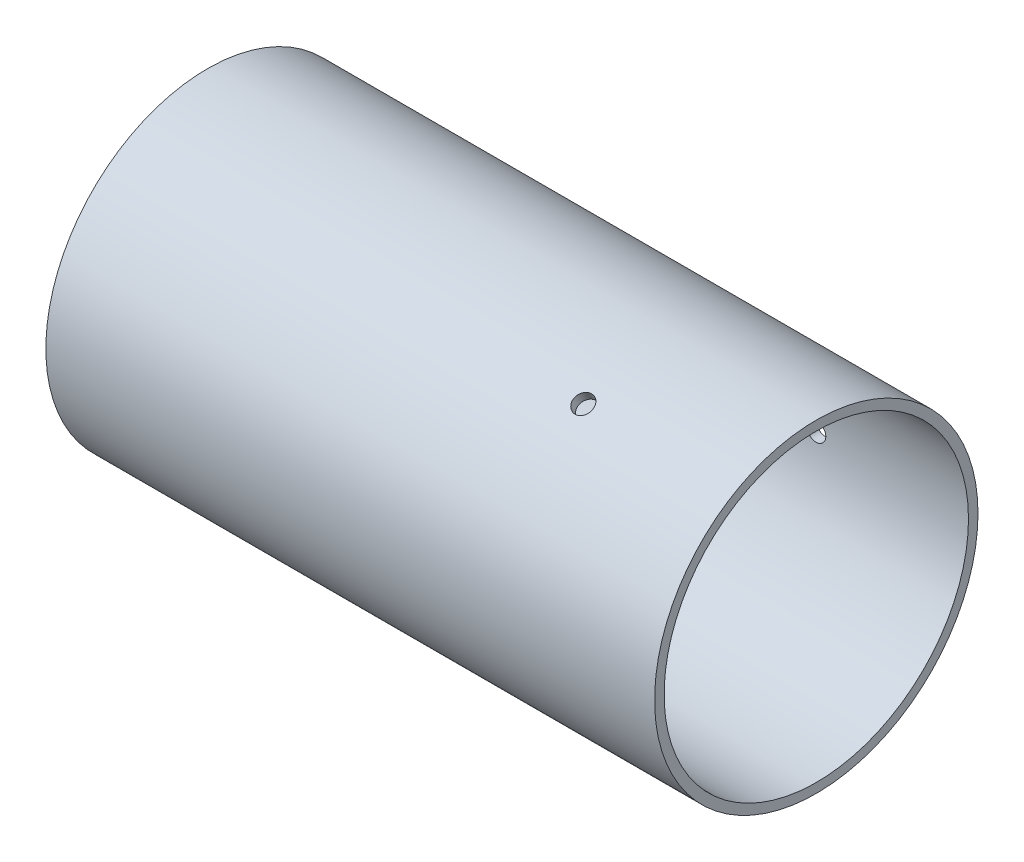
ISO-10303-21;
HEADER;
FILE_DESCRIPTION(('STEP AP214'),'2;1');
FILE_NAME('part.step','',(''),(''),'','','');
FILE_SCHEMA(('AUTOMOTIVE_DESIGN { 1 0 10303 214 1 1 1 1 }'));
ENDSEC;
DATA;
#1=APPLICATION_CONTEXT('core data for automotive mechanical design processes');
#2=APPLICATION_PROTOCOL_DEFINITION('international standard','automotive_design',2000,#1);
#3=PRODUCT_CONTEXT('',#1,'mechanical');
#4=PRODUCT('Part','Part','',(#3));
#5=PRODUCT_RELATED_PRODUCT_CATEGORY('part','',(#4));
#6=PRODUCT_DEFINITION_FORMATION('','',#4);
#7=PRODUCT_DEFINITION_CONTEXT('part definition',#1,'design');
#8=PRODUCT_DEFINITION('design','',#6,#7);
#9=PRODUCT_DEFINITION_SHAPE('','',#8);
#10=(LENGTH_UNIT() NAMED_UNIT(*) SI_UNIT(.MILLI.,.METRE.));
#11=(NAMED_UNIT(*) PLANE_ANGLE_UNIT() SI_UNIT($,.RADIAN.));
#12=(NAMED_UNIT(*) SI_UNIT($,.STERADIAN.) SOLID_ANGLE_UNIT());
#13=UNCERTAINTY_MEASURE_WITH_UNIT(LENGTH_MEASURE(1.E-05),#10,'distance_accuracy_value','');
#14=(GEOMETRIC_REPRESENTATION_CONTEXT(3) GLOBAL_UNCERTAINTY_ASSIGNED_CONTEXT((#13)) GLOBAL_UNIT_ASSIGNED_CONTEXT((#10,
#11,#12)) REPRESENTATION_CONTEXT('',''));
#15=CARTESIAN_POINT('',(0.,0.,0.));
#16=DIRECTION('',(0.,0.,1.));
#17=DIRECTION('',(1.,0.,0.));
#18=AXIS2_PLACEMENT_3D('',#15,#16,#17);
#19=CARTESIAN_POINT('',(101.6,0.,0.));
#20=DIRECTION('',(1.,0.,0.));
#21=DIRECTION('',(0.,0.,-1.));
#22=AXIS2_PLACEMENT_3D('',#19,#20,#21);
#23=PLANE('',#22);
#24=CARTESIAN_POINT('',(101.6,0.,0.));
#25=DIRECTION('',(1.,0.,0.));
#26=DIRECTION('',(0.,0.,-1.));
#27=AXIS2_PLACEMENT_3D('',#24,#25,#26);
#28=CIRCLE('',#27,26.9875);
#29=CARTESIAN_POINT('',(101.6,0.,-26.9875));
#30=VERTEX_POINT('',#29);
#31=EDGE_CURVE('E10',#30,#30,#28,.T.);
#32=ORIENTED_EDGE('',*,*,#31,.T.);
#33=EDGE_LOOP('',(#32));
#34=FACE_BOUND('',#33,.T.);
#35=CARTESIAN_POINT('',(101.6,0.,0.));
#36=DIRECTION('',(1.,0.,0.));
#37=DIRECTION('',(0.,0.,-1.));
#38=AXIS2_PLACEMENT_3D('',#35,#36,#37);
#39=CIRCLE('',#38,25.4);
#40=CARTESIAN_POINT('',(101.6,0.,-25.4));
#41=VERTEX_POINT('',#40);
#42=EDGE_CURVE('E47',#41,#41,#39,.T.);
#43=ORIENTED_EDGE('',*,*,#42,.F.);
#44=EDGE_LOOP('',(#43));
#45=FACE_BOUND('',#44,.T.);
#46=ADVANCED_FACE('F29',(#34,#45),#23,.T.);
#47=CARTESIAN_POINT('',(0.,0.,0.));
#48=DIRECTION('',(1.,0.,0.));
#49=DIRECTION('',(0.,0.,-1.));
#50=AXIS2_PLACEMENT_3D('',#47,#48,#49);
#51=PLANE('',#50);
#52=CARTESIAN_POINT('',(0.,0.,0.));
#53=DIRECTION('',(1.,0.,0.));
#54=DIRECTION('',(0.,0.,-1.));
#55=AXIS2_PLACEMENT_3D('',#52,#53,#54);
#56=CIRCLE('',#55,26.9875);
#57=CARTESIAN_POINT('',(0.,0.,-26.9875));
#58=VERTEX_POINT('',#57);
#59=EDGE_CURVE('E42',#58,#58,#56,.T.);
#60=ORIENTED_EDGE('',*,*,#59,.F.);
#61=EDGE_LOOP('',(#60));
#62=FACE_BOUND('',#61,.T.);
#63=CARTESIAN_POINT('',(0.,0.,0.));
#64=DIRECTION('',(1.,0.,0.));
#65=DIRECTION('',(0.,0.,-1.));
#66=AXIS2_PLACEMENT_3D('',#63,#64,#65);
#67=CIRCLE('',#66,25.4);
#68=CARTESIAN_POINT('',(0.,0.,-25.4));
#69=VERTEX_POINT('',#68);
#70=EDGE_CURVE('E78',#69,#69,#67,.T.);
#71=ORIENTED_EDGE('',*,*,#70,.T.);
#72=EDGE_LOOP('',(#71));
#73=FACE_BOUND('',#72,.T.);
#74=ADVANCED_FACE('F89',(#62,#73),#51,.F.);
#75=CARTESIAN_POINT('',(101.6,0.,0.));
#76=DIRECTION('',(-1.,0.,0.));
#77=DIRECTION('',(0.,0.,1.));
#78=AXIS2_PLACEMENT_3D('',#75,#76,#77);
#79=CYLINDRICAL_SURFACE('',#78,26.9875);
#80=CARTESIAN_POINT('',(76.2,-22.5376398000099,14.8451995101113));
#81=CARTESIAN_POINT('',(76.289087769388,-22.5376423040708,14.8451964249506));
#82=CARTESIAN_POINT('',(76.3782381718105,-22.5417887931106,14.8389065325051));
#83=CARTESIAN_POINT('',(76.5540780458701,-22.5582388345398,14.8138864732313));
#84=CARTESIAN_POINT('',(76.6407645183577,-22.5705519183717,14.7951417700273));
#85=CARTESIAN_POINT('',(76.8091039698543,-22.6028857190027,14.7456970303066));
#86=CARTESIAN_POINT('',(76.8907595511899,-22.6229024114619,14.7150032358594));
#87=CARTESIAN_POINT('',(77.0467482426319,-22.6699237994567,14.6424578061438));
#88=CARTESIAN_POINT('',(77.1210830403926,-22.6969268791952,14.600608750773));
#89=CARTESIAN_POINT('',(77.2604418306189,-22.7570150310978,14.5067750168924));
#90=CARTESIAN_POINT('',(77.3254546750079,-22.7901072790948,14.4547783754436));
#91=CARTESIAN_POINT('',(77.4442287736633,-22.8612240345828,14.3420369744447));
#92=CARTESIAN_POINT('',(77.4979895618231,-22.8992487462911,14.2812918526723));
#93=CARTESIAN_POINT('',(77.5927666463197,-22.9789967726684,14.1526177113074));
#94=CARTESIAN_POINT('',(77.6337738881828,-23.0207226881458,14.0846836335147));
#95=CARTESIAN_POINT('',(77.7018218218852,-23.1065083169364,13.9435019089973));
#96=CARTESIAN_POINT('',(77.7288626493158,-23.1505680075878,13.8702543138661));
#97=CARTESIAN_POINT('',(77.7681796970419,-23.2396042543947,13.7205510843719));
#98=CARTESIAN_POINT('',(77.7804731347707,-23.2845796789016,13.6440992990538));
#99=CARTESIAN_POINT('',(77.7899995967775,-23.3741648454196,13.4900523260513));
#100=CARTESIAN_POINT('',(77.7872327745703,-23.4187745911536,13.41245715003));
#101=CARTESIAN_POINT('',(77.7667314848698,-23.5063164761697,13.2584343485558));
#102=CARTESIAN_POINT('',(77.7490155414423,-23.5492506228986,13.1820053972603));
#103=CARTESIAN_POINT('',(77.6991476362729,-23.6323579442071,13.0324264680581));
#104=CARTESIAN_POINT('',(77.6669955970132,-23.6725311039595,12.959276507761));
#105=CARTESIAN_POINT('',(77.5891471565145,-23.7491343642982,12.8183546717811));
#106=CARTESIAN_POINT('',(77.5434423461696,-23.7855621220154,12.7505861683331));
#107=CARTESIAN_POINT('',(77.4397918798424,-23.8537885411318,12.6224880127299));
#108=CARTESIAN_POINT('',(77.3818461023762,-23.8855871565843,12.562158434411));
#109=CARTESIAN_POINT('',(77.255253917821,-23.9438940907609,12.450665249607));
#110=CARTESIAN_POINT('',(77.1865914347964,-23.9703943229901,12.3995156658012));
#111=CARTESIAN_POINT('',(77.0405712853,-24.0174850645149,12.3080551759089));
#112=CARTESIAN_POINT('',(76.9632136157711,-24.0380755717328,12.2677442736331));
#113=CARTESIAN_POINT('',(76.801988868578,-24.0729318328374,12.1992046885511));
#114=CARTESIAN_POINT('',(76.7181214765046,-24.0871972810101,12.1709765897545));
#115=CARTESIAN_POINT('',(76.546262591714,-24.1091224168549,12.1274882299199));
#116=CARTESIAN_POINT('',(76.4582711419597,-24.1167821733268,12.1122278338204));
#117=CARTESIAN_POINT('',(76.2808030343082,-24.1253425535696,12.0951682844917));
#118=CARTESIAN_POINT('',(76.1913287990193,-24.1262532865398,12.0933489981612));
#119=CARTESIAN_POINT('',(76.0133108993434,-24.1213250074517,12.103175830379));
#120=CARTESIAN_POINT('',(75.9247672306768,-24.1154860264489,12.114821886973));
#121=CARTESIAN_POINT('',(75.7511873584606,-24.0971764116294,12.1511997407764));
#122=CARTESIAN_POINT('',(75.6661487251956,-24.0847104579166,12.1759223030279));
#123=CARTESIAN_POINT('',(75.5019179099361,-24.0533912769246,12.2376760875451));
#124=CARTESIAN_POINT('',(75.4227257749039,-24.0345379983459,12.2747074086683));
#125=CARTESIAN_POINT('',(75.2723325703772,-23.9907935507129,12.3599867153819));
#126=CARTESIAN_POINT('',(75.2011411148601,-23.9658952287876,12.4082479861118));
#127=CARTESIAN_POINT('',(75.068866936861,-23.9105895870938,12.5144891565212));
#128=CARTESIAN_POINT('',(75.0077843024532,-23.880182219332,12.572469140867));
#129=CARTESIAN_POINT('',(74.8973858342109,-23.8144826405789,12.696475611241));
#130=CARTESIAN_POINT('',(74.8480845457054,-23.7791844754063,12.762511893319));
#131=CARTESIAN_POINT('',(74.76274775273,-23.7045521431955,12.9006013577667));
#132=CARTESIAN_POINT('',(74.7267121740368,-23.6652179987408,12.9726545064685));
#133=CARTESIAN_POINT('',(74.668955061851,-23.5835127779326,13.120602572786));
#134=CARTESIAN_POINT('',(74.6472242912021,-23.5411436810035,13.1964949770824));
#135=CARTESIAN_POINT('',(74.6186634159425,-23.4544592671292,13.3499535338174));
#136=CARTESIAN_POINT('',(74.6118331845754,-23.4101439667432,13.4275196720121));
#137=CARTESIAN_POINT('',(74.6132684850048,-23.3208676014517,13.5819820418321));
#138=CARTESIAN_POINT('',(74.6215112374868,-23.2759076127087,13.6588791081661));
#139=CARTESIAN_POINT('',(74.6528113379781,-23.1865885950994,13.8099590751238));
#140=CARTESIAN_POINT('',(74.6758687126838,-23.1422295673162,13.8841419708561));
#141=CARTESIAN_POINT('',(74.7361385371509,-23.055466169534,14.0277467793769));
#142=CARTESIAN_POINT('',(74.773350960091,-23.0130617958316,14.0971687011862));
#143=CARTESIAN_POINT('',(74.8608711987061,-22.9315529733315,14.2293735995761));
#144=CARTESIAN_POINT('',(74.9111786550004,-22.8924484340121,14.2921567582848));
#145=CARTESIAN_POINT('',(75.0235444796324,-22.8187681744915,14.4095034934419));
#146=CARTESIAN_POINT('',(75.0856191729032,-22.7841988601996,14.4640554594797));
#147=CARTESIAN_POINT('',(75.2197381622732,-22.7208166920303,14.5634174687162));
#148=CARTESIAN_POINT('',(75.2917848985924,-22.69200525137,14.6082251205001));
#149=CARTESIAN_POINT('',(75.4438769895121,-22.6411235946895,14.6869631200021));
#150=CARTESIAN_POINT('',(75.52393145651,-22.6190611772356,14.72088088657));
#151=CARTESIAN_POINT('',(75.6896418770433,-22.5825298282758,14.7768613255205));
#152=CARTESIAN_POINT('',(75.7752911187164,-22.5680519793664,14.7989379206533));
#153=CARTESIAN_POINT('',(75.9178891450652,-22.5509876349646,14.8249198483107));
#154=CARTESIAN_POINT('',(75.9739155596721,-22.5459901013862,14.8325157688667));
#155=CARTESIAN_POINT('',(76.0866195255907,-22.5393153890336,14.8426565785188));
#156=CARTESIAN_POINT('',(76.1432970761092,-22.5376382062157,14.8452014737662));
#157=CARTESIAN_POINT('',(76.2,-22.5376398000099,14.8451995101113));
#158=B_SPLINE_CURVE_WITH_KNOTS('',3,(#80,#81,#82,#83,#84,#85,#86,#87,#88,#89,#90,#91,#92,#93,
#94,#95,#96,#97,#98,#99,#100,#101,#102,#103,#104,#105,#106,#107,#108,#109,#110,#111,#112,#113,
#114,#115,#116,#117,#118,#119,#120,#121,#122,#123,#124,#125,#126,#127,#128,#129,#130,#131,#132,
#133,#134,#135,#136,#137,#138,#139,#140,#141,#142,#143,#144,#145,#146,#147,#148,#149,#150,#151,
#152,#153,#154,#155,#156,#157),.UNSPECIFIED.,.T.,.F.,(4,2,2,2,2,2,2,2,2,2,2,2,2,2,2,2,2,2,2,2,2,
2,2,2,2,2,2,2,2,2,2,2,2,2,2,2,2,2,4),(0.,0.26705631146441,0.534424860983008,0.80165392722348,
1.068821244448,1.33630544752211,1.60380072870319,1.87148548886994,2.13916765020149,
2.40653699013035,2.67390360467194,2.94093940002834,3.20797662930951,3.47517989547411,
3.74238581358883,4.00999648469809,4.27760724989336,4.54523094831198,4.81285185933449,
5.08007182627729,5.34729056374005,5.61432083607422,5.88135325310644,6.14870319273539,
6.41605546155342,6.68373611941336,6.95141527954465,7.218921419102,7.48642528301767,
7.75352521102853,8.02062562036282,8.28772552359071,8.55481809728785,8.82228396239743,
9.08981539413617,9.35765480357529,9.62517859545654,9.79515582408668,9.96513284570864),.UNSPECIFIED.);
#159=CARTESIAN_POINT('',(76.2,-22.5376398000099,14.8451995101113));
#160=VERTEX_POINT('',#159);
#161=EDGE_CURVE('E118',#160,#160,#158,.T.);
#162=ORIENTED_EDGE('',*,*,#161,.T.);
#163=EDGE_LOOP('',(#162));
#164=FACE_BOUND('',#163,.T.);
#165=CARTESIAN_POINT('',(76.2,24.1251398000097,12.095568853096));
#166=CARTESIAN_POINT('',(76.289087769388,24.1251383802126,12.0955725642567));
#167=CARTESIAN_POINT('',(76.3782381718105,24.1217644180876,12.1023084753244));
#168=CARTESIAN_POINT('',(76.5540780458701,24.1083214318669,12.1290646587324));
#169=CARTESIAN_POINT('',(76.6407645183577,24.0982445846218,12.1491004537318));
#170=CARTESIAN_POINT('',(76.8091039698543,24.0715910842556,12.2018247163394));
#171=CARTESIAN_POINT('',(76.8907595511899,24.0550178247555,12.2345065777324));
#172=CARTESIAN_POINT('',(77.0467482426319,24.0157023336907,12.3115010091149));
#173=CARTESIAN_POINT('',(77.1210830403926,23.9929615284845,12.3558108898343));
#174=CARTESIAN_POINT('',(77.2604418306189,23.9417432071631,12.4547656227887));
#175=CARTESIAN_POINT('',(77.3254546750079,23.9132589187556,12.5094226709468));
#176=CARTESIAN_POINT('',(77.4442287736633,23.8511803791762,12.6273822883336));
#177=CARTESIAN_POINT('',(77.4979895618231,23.8175859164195,12.6906852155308));
#178=CARTESIAN_POINT('',(77.5927666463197,23.746024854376,12.8240861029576));
#179=CARTESIAN_POINT('',(77.6337738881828,23.7080551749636,12.8941888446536));
#180=CARTESIAN_POINT('',(77.7018218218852,23.6286810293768,13.0390722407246));
#181=CARTESIAN_POINT('',(77.7288626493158,23.5872765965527,13.1138528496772));
#182=CARTESIAN_POINT('',(77.7681796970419,23.5021479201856,13.2658121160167));
#183=CARTESIAN_POINT('',(77.7804731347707,23.4584264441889,13.3429878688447));
#184=CARTESIAN_POINT('',(77.7899995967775,23.3698104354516,13.4975943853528));
#185=CARTESIAN_POINT('',(77.7872327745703,23.3249159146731,13.5750251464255));
#186=CARTESIAN_POINT('',(77.7667314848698,23.2352991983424,13.7278500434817));
#187=CARTESIAN_POINT('',(77.7490155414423,23.1905768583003,13.8032465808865));
#188=CARTESIAN_POINT('',(77.6991476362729,23.1025913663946,13.9500090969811));
#189=CARTESIAN_POINT('',(77.6669955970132,23.0593282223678,14.0213750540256));
#190=CARTESIAN_POINT('',(77.5891471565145,22.9755879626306,14.1581763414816));
#191=CARTESIAN_POINT('',(77.5434423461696,22.9351125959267,14.2236079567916));
#192=CARTESIAN_POINT('',(77.4397918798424,22.8582895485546,14.3467428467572));
#193=CARTESIAN_POINT('',(77.3818461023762,22.8219419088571,14.4044460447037));
#194=CARTESIAN_POINT('',(77.255253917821,22.7545394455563,14.5106879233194));
#195=CARTESIAN_POINT('',(77.1865914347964,22.723492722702,14.559212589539));
#196=CARTESIAN_POINT('',(77.0405712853,22.6678309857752,14.6457246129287));
#197=CARTESIAN_POINT('',(76.9632136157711,22.6432159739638,14.6837119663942));
#198=CARTESIAN_POINT('',(76.801988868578,22.6012870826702,14.7481681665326));
#199=CARTESIAN_POINT('',(76.7181214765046,22.5839735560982,14.7746364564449));
#200=CARTESIAN_POINT('',(76.546262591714,22.557274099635,14.8153683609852));
#201=CARTESIAN_POINT('',(76.4582711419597,22.5478880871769,14.8296321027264));
#202=CARTESIAN_POINT('',(76.2808030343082,22.5373942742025,14.845575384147));
#203=CARTESIAN_POINT('',(76.1913287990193,22.5362740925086,14.8472737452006));
#204=CARTESIAN_POINT('',(76.0133108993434,22.5423202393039,14.8380923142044));
#205=CARTESIAN_POINT('',(75.9247672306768,22.5494865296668,14.8272125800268));
#206=CARTESIAN_POINT('',(75.7511873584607,22.5718358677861,14.7931670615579));
#207=CARTESIAN_POINT('',(75.6661487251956,22.5870132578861,14.7700099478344));
#208=CARTESIAN_POINT('',(75.5019179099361,22.6248340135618,14.7120098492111));
#209=CARTESIAN_POINT('',(75.4227257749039,22.6474774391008,14.6771667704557));
#210=CARTESIAN_POINT('',(75.2723325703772,22.6994592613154,14.5966433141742));
#211=CARTESIAN_POINT('',(75.2011411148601,22.7288055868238,14.5509500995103));
#212=CARTESIAN_POINT('',(75.068866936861,22.7931603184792,14.4499334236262));
#213=CARTESIAN_POINT('',(75.0077843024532,22.8281687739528,14.3946098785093));
#214=CARTESIAN_POINT('',(74.8973858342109,22.9027117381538,14.2757091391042));
#215=CARTESIAN_POINT('',(74.8480845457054,22.9422517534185,14.2121218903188));
#216=CARTESIAN_POINT('',(74.76274775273,23.0245245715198,14.0784436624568));
#217=CARTESIAN_POINT('',(74.7267121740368,23.0672573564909,14.0083527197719));
#218=CARTESIAN_POINT('',(74.668955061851,23.1545315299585,13.8636198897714));
#219=CARTESIAN_POINT('',(74.6472242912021,23.1990717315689,13.7889809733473));
#220=CARTESIAN_POINT('',(74.6186634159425,23.2886285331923,13.6371807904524));
#221=CARTESIAN_POINT('',(74.6118331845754,23.3336451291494,13.5600195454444));
#222=CARTESIAN_POINT('',(74.6132684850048,23.4227752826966,13.4054727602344));
#223=CARTESIAN_POINT('',(74.6215112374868,23.4668901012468,13.3280877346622));
#224=CARTESIAN_POINT('',(74.6528113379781,23.5530696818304,13.1751952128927));
#225=CARTESIAN_POINT('',(74.6758687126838,23.5951344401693,13.099687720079));
#226=CARTESIAN_POINT('',(74.7361385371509,23.6761181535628,12.9527460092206));
#227=CARTESIAN_POINT('',(74.773350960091,23.715037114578,12.8813117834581));
#228=CARTESIAN_POINT('',(74.8608711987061,23.7887755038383,12.7446206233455));
#229=CARTESIAN_POINT('',(74.9111786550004,23.8235950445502,12.6793635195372));
#230=CARTESIAN_POINT('',(75.0235444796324,23.8883801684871,12.5568811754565));
#231=CARTESIAN_POINT('',(75.0856191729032,23.9183388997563,12.4996672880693));
#232=CARTESIAN_POINT('',(75.2197381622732,23.9726978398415,12.3950957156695));
#233=CARTESIAN_POINT('',(75.2917848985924,23.9970966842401,12.3477404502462));
#234=CARTESIAN_POINT('',(75.4438769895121,24.0398449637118,12.2643066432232));
#235=CARTESIAN_POINT('',(75.52393145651,24.0581874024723,12.2282411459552));
#236=CARTESIAN_POINT('',(75.6896418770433,24.0884022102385,12.1686138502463));
#237=CARTESIAN_POINT('',(75.7752911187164,24.1002821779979,12.1450373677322));
#238=CARTESIAN_POINT('',(75.9178891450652,24.1142510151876,12.1172682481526));
#239=CARTESIAN_POINT('',(75.9739155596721,24.118330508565,12.1091422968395));
#240=CARTESIAN_POINT('',(76.0866195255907,24.1237753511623,12.0982914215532));
#241=CARTESIAN_POINT('',(76.1432970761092,24.1251407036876,12.0955664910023));
#242=CARTESIAN_POINT('',(76.2,24.1251398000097,12.095568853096));
#243=B_SPLINE_CURVE_WITH_KNOTS('',3,(#165,#166,#167,#168,#169,#170,#171,#172,#173,#174,#175,
#176,#177,#178,#179,#180,#181,#182,#183,#184,#185,#186,#187,#188,#189,#190,#191,#192,#193,#194,
#195,#196,#197,#198,#199,#200,#201,#202,#203,#204,#205,#206,#207,#208,#209,#210,#211,#212,#213,
#214,#215,#216,#217,#218,#219,#220,#221,#222,#223,#224,#225,#226,#227,#228,#229,#230,#231,#232,
#233,#234,#235,#236,#237,#238,#239,#240,#241,#242),.UNSPECIFIED.,.T.,.F.,(4,2,2,2,2,2,2,2,2,2,2,
2,2,2,2,2,2,2,2,2,2,2,2,2,2,2,2,2,2,2,2,2,2,2,2,2,2,2,4),(0.,0.26705631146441,0.534424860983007,
0.801653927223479,1.068821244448,1.33630544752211,1.60380072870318,1.87148548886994,
2.13916765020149,2.40653699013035,2.67390360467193,2.94093940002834,3.20797662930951,
3.47517989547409,3.74238581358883,4.00999648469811,4.27760724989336,4.54523094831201,
4.81285185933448,5.08007182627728,5.34729056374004,5.61432083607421,5.88135325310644,
6.1487031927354,6.41605546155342,6.68373611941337,6.95141527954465,7.218921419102,
7.48642528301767,7.75352521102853,8.02062562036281,8.28772552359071,8.55481809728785,
8.82228396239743,9.08981539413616,9.35765480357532,9.62517859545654,9.79515582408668,
9.96513284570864),.UNSPECIFIED.);
#244=CARTESIAN_POINT('',(76.2,24.1251398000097,12.095568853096));
#245=VERTEX_POINT('',#244);
#246=EDGE_CURVE('E57',#245,#245,#243,.T.);
#247=ORIENTED_EDGE('',*,*,#246,.T.);
#248=EDGE_LOOP('',(#247));
#249=FACE_BOUND('',#248,.T.);
#250=CARTESIAN_POINT('',(77.7875,0.,-26.9875));
#251=CARTESIAN_POINT('',(77.7874960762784,0.0890879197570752,-26.9874993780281));
#252=CARTESIAN_POINT('',(77.7799756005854,0.178238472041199,-26.9870541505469));
#253=CARTESIAN_POINT('',(77.7500824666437,0.354078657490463,-26.9853208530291));
#254=CARTESIAN_POINT('',(77.7276924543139,0.440765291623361,-26.9840317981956));
#255=CARTESIAN_POINT('',(77.6687049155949,0.609105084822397,-26.980756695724));
#256=CARTESIAN_POINT('',(77.6321148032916,0.690760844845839,-26.9787710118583));
#257=CARTESIAN_POINT('',(77.5457775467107,0.84674983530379,-26.9743260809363));
#258=CARTESIAN_POINT('',(77.4960334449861,0.921084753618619,-26.9718669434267));
#259=CARTESIAN_POINT('',(77.3847267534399,1.06044340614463,-26.9667478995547));
#260=CARTESIAN_POINT('',(77.3231502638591,1.12545603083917,-26.9640877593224));
#261=CARTESIAN_POINT('',(77.1899551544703,1.24422970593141,-26.9588685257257));
#262=CARTESIAN_POINT('',(77.1183361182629,1.29799028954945,-26.9563094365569));
#263=CARTESIAN_POINT('',(76.9670271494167,1.39276716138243,-26.9515791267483));
#264=CARTESIAN_POINT('',(76.8873315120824,1.43377435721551,-26.9494081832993));
#265=CARTESIAN_POINT('',(76.7221716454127,1.50182219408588,-26.9457019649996));
#266=CARTESIAN_POINT('',(76.6367074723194,1.52886297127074,-26.9441666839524));
#267=CARTESIAN_POINT('',(76.462542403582,1.5681799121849,-26.941907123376));
#268=CARTESIAN_POINT('',(76.3738454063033,1.58047328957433,-26.9411818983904));
#269=CARTESIAN_POINT('',(76.1956440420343,1.5899995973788,-26.9406214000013));
#270=CARTESIAN_POINT('',(76.1061396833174,1.58723268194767,-26.9407861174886));
#271=CARTESIAN_POINT('',(75.9289814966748,1.56673124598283,-26.9419860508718));
#272=CARTESIAN_POINT('',(75.8413255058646,1.54901534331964,-26.9430201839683));
#273=CARTESIAN_POINT('',(75.6702336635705,1.49914769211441,-26.9458406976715));
#274=CARTESIAN_POINT('',(75.5867978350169,1.46699586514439,-26.9476270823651));
#275=CARTESIAN_POINT('',(75.4264548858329,1.38914786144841,-26.9517520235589));
#276=CARTESIAN_POINT('',(75.3495518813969,1.34344322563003,-26.9540909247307));
#277=CARTESIAN_POINT('',(75.2045025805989,1.23979313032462,-26.959056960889));
#278=CARTESIAN_POINT('',(75.1363563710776,1.18184754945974,-26.9616840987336));
#279=CARTESIAN_POINT('',(75.0106467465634,1.05525550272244,-26.9669353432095));
#280=CARTESIAN_POINT('',(74.9530995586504,0.986592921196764,-26.9695594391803));
#281=CARTESIAN_POINT('',(74.8503466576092,0.840572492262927,-26.9745050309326));
#282=CARTESIAN_POINT('',(74.8051409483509,0.76321464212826,-26.9768265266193));
#283=CARTESIAN_POINT('',(74.7283556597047,0.601989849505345,-26.9809054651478));
#284=CARTESIAN_POINT('',(74.6967766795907,0.518122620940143,-26.9826628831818));
#285=CARTESIAN_POINT('',(74.6481520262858,0.346264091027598,-26.9854152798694));
#286=CARTESIAN_POINT('',(74.6311062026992,0.258272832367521,-26.986410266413));
#287=CARTESIAN_POINT('',(74.6120518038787,0.0808048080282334,-26.9875246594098));
#288=CARTESIAN_POINT('',(74.6100207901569,-0.00866954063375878,-26.9876453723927));
#289=CARTESIAN_POINT('',(74.6209950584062,-0.18668769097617,-26.9870010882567));
#290=CARTESIAN_POINT('',(74.6340002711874,-0.275231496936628,-26.9862360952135));
#291=CARTESIAN_POINT('',(74.6746592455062,-0.448812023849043,-26.9839073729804));
#292=CARTESIAN_POINT('',(74.70230272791,-0.533851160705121,-26.9823442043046));
#293=CARTESIAN_POINT('',(74.7714431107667,-0.698082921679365,-26.9785950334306));
#294=CARTESIAN_POINT('',(74.8129401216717,-0.777275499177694,-26.9764090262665));
#295=CARTESIAN_POINT('',(74.9086668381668,-0.927668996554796,-26.9716566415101));
#296=CARTESIAN_POINT('',(74.9629115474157,-0.99886035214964,-26.9690898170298));
#297=CARTESIAN_POINT('',(75.0825719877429,-1.13113429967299,-26.9638662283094));
#298=CARTESIAN_POINT('',(75.1479878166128,-1.19221680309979,-26.9612094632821));
#299=CARTESIAN_POINT('',(75.2882303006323,-1.30261500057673,-26.956101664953));
#300=CARTESIAN_POINT('',(75.3630684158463,-1.35191615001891,-26.953650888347));
#301=CARTESIAN_POINT('',(75.5199733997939,-1.43725269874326,-26.9492355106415));
#302=CARTESIAN_POINT('',(75.6020402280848,-1.47328817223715,-26.9472709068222));
#303=CARTESIAN_POINT('',(75.7710196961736,-1.53104521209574,-26.9440512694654));
#304=CARTESIAN_POINT('',(75.8579291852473,-1.55277597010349,-26.9427957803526));
#305=CARTESIAN_POINT('',(76.0341708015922,-1.58133675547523,-26.941134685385));
#306=CARTESIAN_POINT('',(76.1235029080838,-1.58816691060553,-26.9407290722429));
#307=CARTESIAN_POINT('',(76.3019092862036,-1.5867313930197,-26.9408136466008));
#308=CARTESIAN_POINT('',(76.3909837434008,-1.57848859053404,-26.9413024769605));
#309=CARTESIAN_POINT('',(76.5664816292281,-1.54718851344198,-26.9431179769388));
#310=CARTESIAN_POINT('',(76.6529050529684,-1.52413121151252,-26.9444446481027));
#311=CARTESIAN_POINT('',(76.8206514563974,-1.46386166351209,-26.9477859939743));
#312=CARTESIAN_POINT('',(76.9019744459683,-1.42664944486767,-26.9498006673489));
#313=CARTESIAN_POINT('',(77.0572210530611,-1.33912972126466,-26.9542909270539));
#314=CARTESIAN_POINT('',(77.1311448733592,-1.28882257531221,-26.9567665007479));
#315=CARTESIAN_POINT('',(77.2696102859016,-1.1764570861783,-26.9619039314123));
#316=CARTESIAN_POINT('',(77.3341385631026,-1.11438234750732,-26.9645660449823));
#317=CARTESIAN_POINT('',(77.4518801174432,-0.980263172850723,-26.9697744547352));
#318=CARTESIAN_POINT('',(77.5050906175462,-0.908216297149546,-26.9723207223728));
#319=CARTESIAN_POINT('',(77.5987207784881,-0.756124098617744,-26.9770128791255));
#320=CARTESIAN_POINT('',(77.6391256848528,-0.676069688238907,-26.9791583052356));
#321=CARTESIAN_POINT('',(77.7058719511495,-0.510359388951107,-26.9828006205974));
#322=CARTESIAN_POINT('',(77.7322298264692,-0.42471021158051,-26.9842982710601));
#323=CARTESIAN_POINT('',(77.763263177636,-0.282112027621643,-26.9860826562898));
#324=CARTESIAN_POINT('',(77.7723402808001,-0.226085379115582,-26.9866118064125));
#325=CARTESIAN_POINT('',(77.7844599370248,-0.113380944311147,-26.9873206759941));
#326=CARTESIAN_POINT('',(77.7875024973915,-0.0567031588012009,-26.987500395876));
#327=CARTESIAN_POINT('',(77.7875,0.,-26.9875));
#328=B_SPLINE_CURVE_WITH_KNOTS('',3,(#250,#251,#252,#253,#254,#255,#256,#257,#258,#259,#260,
#261,#262,#263,#264,#265,#266,#267,#268,#269,#270,#271,#272,#273,#274,#275,#276,#277,#278,#279,
#280,#281,#282,#283,#284,#285,#286,#287,#288,#289,#290,#291,#292,#293,#294,#295,#296,#297,#298,
#299,#300,#301,#302,#303,#304,#305,#306,#307,#308,#309,#310,#311,#312,#313,#314,#315,#316,#317,
#318,#319,#320,#321,#322,#323,#324,#325,#326,#327),.UNSPECIFIED.,.T.,.F.,(4,2,2,2,2,2,2,2,2,2,2,
2,2,2,2,2,2,2,2,2,2,2,2,2,2,2,2,2,2,2,2,2,2,2,2,2,2,2,4),(0.,0.267056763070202,
0.534425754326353,0.801655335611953,1.0688231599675,1.33630677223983,1.60380147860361,
1.87148645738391,2.13916882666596,2.40653844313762,2.67390532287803,2.94093970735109,
3.20797554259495,3.47517840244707,3.74238391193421,4.00999517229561,4.27760651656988,
4.54522962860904,4.81284997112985,5.08007029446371,5.34728938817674,5.61432108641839,
5.88135491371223,6.14870461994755,6.41605666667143,6.68373708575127,6.95141600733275,
7.21892276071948,7.48642722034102,7.75352613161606,8.0206255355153,8.28772442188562,
8.5548159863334,8.82228245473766,9.08981447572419,9.35765363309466,9.62517718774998,
9.79515511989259,9.96513284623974),.UNSPECIFIED.);
#329=CARTESIAN_POINT('',(77.7875,0.,-26.9875));
#330=VERTEX_POINT('',#329);
#331=EDGE_CURVE('E56',#330,#330,#328,.T.);
#332=ORIENTED_EDGE('',*,*,#331,.T.);
#333=EDGE_LOOP('',(#332));
#334=FACE_BOUND('',#333,.T.);
#335=ORIENTED_EDGE('',*,*,#31,.F.);
#336=EDGE_LOOP('',(#335));
#337=FACE_BOUND('',#336,.T.);
#338=ORIENTED_EDGE('',*,*,#59,.T.);
#339=EDGE_LOOP('',(#338));
#340=FACE_BOUND('',#339,.T.);
#341=ADVANCED_FACE('F31',(#164,#249,#334,#337,#340),#79,.T.);
#342=CARTESIAN_POINT('',(101.6,0.,0.));
#343=DIRECTION('',(-1.,0.,0.));
#344=DIRECTION('',(0.,0.,1.));
#345=AXIS2_PLACEMENT_3D('',#342,#343,#344);
#346=CYLINDRICAL_SURFACE('',#345,25.4);
#347=CARTESIAN_POINT('',(76.2,-21.1602902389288,14.049986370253));
#348=CARTESIAN_POINT('',(76.289077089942,-21.1602927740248,14.0499833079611));
#349=CARTESIAN_POINT('',(76.3782165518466,-21.1644625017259,14.043708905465));
#350=CARTESIAN_POINT('',(76.5540341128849,-21.1810026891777,14.0187496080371));
#351=CARTESIAN_POINT('',(76.6407092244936,-21.1933826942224,14.0000502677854));
#352=CARTESIAN_POINT('',(76.8090258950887,-21.2258856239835,13.9507220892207));
#353=CARTESIAN_POINT('',(76.8906700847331,-21.2460044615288,13.9200995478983));
#354=CARTESIAN_POINT('',(77.0466382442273,-21.2932532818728,13.8477154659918));
#355=CARTESIAN_POINT('',(77.1209638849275,-21.3203816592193,13.8059564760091));
#356=CARTESIAN_POINT('',(77.2603181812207,-21.3807334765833,13.7123059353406));
#357=CARTESIAN_POINT('',(77.3253343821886,-21.4139649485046,13.66040102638));
#358=CARTESIAN_POINT('',(77.4441176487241,-21.4853549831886,13.5478394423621));
#359=CARTESIAN_POINT('',(77.4978842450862,-21.5235137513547,13.4871824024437));
#360=CARTESIAN_POINT('',(77.5926800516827,-21.6035137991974,13.3586644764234));
#361=CARTESIAN_POINT('',(77.6336990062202,-21.6453580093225,13.2907978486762));
#362=CARTESIAN_POINT('',(77.7017694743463,-21.7313477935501,13.1497277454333));
#363=CARTESIAN_POINT('',(77.7288211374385,-21.7754933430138,13.0765243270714));
#364=CARTESIAN_POINT('',(77.7681547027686,-21.8646523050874,12.9268925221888));
#365=CARTESIAN_POINT('',(77.780456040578,-21.9096644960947,12.8504685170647));
#366=CARTESIAN_POINT('',(77.7899997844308,-21.9992760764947,12.6964478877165));
#367=CARTESIAN_POINT('',(77.7872423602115,-22.0438754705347,12.6188512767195));
#368=CARTESIAN_POINT('',(77.7667628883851,-22.1313431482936,12.4648099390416));
#369=CARTESIAN_POINT('',(77.7490617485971,-22.1742137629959,12.3883637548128));
#370=CARTESIAN_POINT('',(77.6992297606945,-22.2571547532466,12.238724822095));
#371=CARTESIAN_POINT('',(77.6670988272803,-22.29722511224,12.1655320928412));
#372=CARTESIAN_POINT('',(77.5892956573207,-22.3735979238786,12.0244982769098));
#373=CARTESIAN_POINT('',(77.5436139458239,-22.4098977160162,11.9566609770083));
#374=CARTESIAN_POINT('',(77.4400128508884,-22.4778547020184,11.8284117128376));
#375=CARTESIAN_POINT('',(77.3820933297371,-22.5095118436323,11.767999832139));
#376=CARTESIAN_POINT('',(77.2555426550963,-22.5675443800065,11.6563251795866));
#377=CARTESIAN_POINT('',(77.18689335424,-22.5939106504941,11.6050782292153));
#378=CARTESIAN_POINT('',(77.0408954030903,-22.6407505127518,11.5134301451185));
#379=CARTESIAN_POINT('',(76.963546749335,-22.6612241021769,11.4730290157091));
#380=CARTESIAN_POINT('',(76.802334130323,-22.6958776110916,11.4043249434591));
#381=CARTESIAN_POINT('',(76.7184697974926,-22.7100571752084,11.3760226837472));
#382=CARTESIAN_POINT('',(76.546611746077,-22.7318516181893,11.3324102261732));
#383=CARTESIAN_POINT('',(76.458618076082,-22.7394665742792,11.317099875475));
#384=CARTESIAN_POINT('',(76.2811584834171,-22.7479833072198,11.2999711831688));
#385=CARTESIAN_POINT('',(76.1916953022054,-22.7488964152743,11.2981300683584));
#386=CARTESIAN_POINT('',(76.0136961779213,-22.7440226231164,11.3079380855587));
#387=CARTESIAN_POINT('',(75.9251602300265,-22.7382357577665,11.3195871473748));
#388=CARTESIAN_POINT('',(75.7516005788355,-22.7200762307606,11.3559915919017));
#389=CARTESIAN_POINT('',(75.6665741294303,-22.7077088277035,11.3807365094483));
#390=CARTESIAN_POINT('',(75.5023623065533,-22.6766233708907,11.442549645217));
#391=CARTESIAN_POINT('',(75.4231769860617,-22.6579052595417,11.4796179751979));
#392=CARTESIAN_POINT('',(75.2727785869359,-22.6144509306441,11.5649858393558));
#393=CARTESIAN_POINT('',(75.2015763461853,-22.5897066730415,11.613300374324));
#394=CARTESIAN_POINT('',(75.0692744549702,-22.53471402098,11.7196517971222));
#395=CARTESIAN_POINT('',(75.0081749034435,-22.5044655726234,11.7776887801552));
#396=CARTESIAN_POINT('',(74.8977270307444,-22.4390664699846,11.9018155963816));
#397=CARTESIAN_POINT('',(74.8483951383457,-22.403909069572,11.9679164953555));
#398=CARTESIAN_POINT('',(74.7629953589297,-22.329528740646,12.1061264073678));
#399=CARTESIAN_POINT('',(74.7269273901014,-22.2903058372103,12.1782353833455));
#400=CARTESIAN_POINT('',(74.6691078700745,-22.2087845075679,12.3262735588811));
#401=CARTESIAN_POINT('',(74.6473459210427,-22.1664883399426,12.4021999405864));
#402=CARTESIAN_POINT('',(74.618722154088,-22.0799008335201,12.5557055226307));
#403=CARTESIAN_POINT('',(74.6118601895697,-22.0356095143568,12.6332847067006));
#404=CARTESIAN_POINT('',(74.6132326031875,-21.9463387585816,12.7877346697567));
#405=CARTESIAN_POINT('',(74.6214412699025,-21.9013606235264,12.8646064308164));
#406=CARTESIAN_POINT('',(74.6526686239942,-21.8119573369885,13.015614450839));
#407=CARTESIAN_POINT('',(74.6756873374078,-21.7675321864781,13.0897507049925));
#408=CARTESIAN_POINT('',(74.7358755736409,-21.6805962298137,13.2332456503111));
#409=CARTESIAN_POINT('',(74.7730449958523,-21.6380854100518,13.3026043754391));
#410=CARTESIAN_POINT('',(74.8604759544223,-21.5563342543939,13.4346750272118));
#411=CARTESIAN_POINT('',(74.9107371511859,-21.5170938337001,13.4973871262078));
#412=CARTESIAN_POINT('',(75.0230198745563,-21.4431189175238,13.6146050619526));
#413=CARTESIAN_POINT('',(75.0850599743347,-21.40839168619,13.669097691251));
#414=CARTESIAN_POINT('',(75.2191147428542,-21.3446958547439,13.7683494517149));
#415=CARTESIAN_POINT('',(75.291131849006,-21.3157286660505,13.8131061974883));
#416=CARTESIAN_POINT('',(75.4431786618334,-21.2645511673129,13.8917628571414));
#417=CARTESIAN_POINT('',(75.5232182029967,-21.2423492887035,13.9256492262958));
#418=CARTESIAN_POINT('',(75.6889083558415,-21.2055729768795,13.9815881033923));
#419=CARTESIAN_POINT('',(75.7745522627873,-21.1909896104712,14.0036544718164));
#420=CARTESIAN_POINT('',(75.9172667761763,-21.173774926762,14.0296611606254));
#421=CARTESIAN_POINT('',(75.9734148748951,-21.1687262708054,14.0372741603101));
#422=CARTESIAN_POINT('',(76.0863668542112,-21.1619831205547,14.047437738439));
#423=CARTESIAN_POINT('',(76.1431707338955,-21.1602886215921,14.0499883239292));
#424=CARTESIAN_POINT('',(76.2,-21.1602902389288,14.049986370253));
#425=B_SPLINE_CURVE_WITH_KNOTS('',3,(#347,#348,#349,#350,#351,#352,#353,#354,#355,#356,#357,
#358,#359,#360,#361,#362,#363,#364,#365,#366,#367,#368,#369,#370,#371,#372,#373,#374,#375,#376,
#377,#378,#379,#380,#381,#382,#383,#384,#385,#386,#387,#388,#389,#390,#391,#392,#393,#394,#395,
#396,#397,#398,#399,#400,#401,#402,#403,#404,#405,#406,#407,#408,#409,#410,#411,#412,#413,#414,
#415,#416,#417,#418,#419,#420,#421,#422,#423,#424),.UNSPECIFIED.,.T.,.F.,(4,2,2,2,2,2,2,2,2,2,2,
2,2,2,2,2,2,2,2,2,2,2,2,2,2,2,2,2,2,2,2,2,2,2,2,2,2,2,4),(0.,0.267023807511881,
0.534358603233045,0.801552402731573,1.06868505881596,1.33617182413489,1.60366974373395,
1.87138231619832,2.13909202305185,2.40644859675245,2.67380215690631,2.94078228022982,
3.20776398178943,3.47493280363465,3.74210463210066,4.00973332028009,4.27736211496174,
4.54500601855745,4.81264677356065,5.07983490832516,5.34702165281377,5.61399520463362,
5.88097117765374,6.14830531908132,6.41564207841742,6.68334990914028,6.95105608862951,
7.21856747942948,7.48607623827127,7.75312903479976,8.02018230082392,8.28723366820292,
8.55427810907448,8.82174718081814,9.08928171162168,9.35714831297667,9.62470011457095,
9.79505579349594,9.9654112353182),.UNSPECIFIED.);
#426=CARTESIAN_POINT('',(76.2,-21.1602902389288,14.049986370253));
#427=VERTEX_POINT('',#426);
#428=EDGE_CURVE('E34',#427,#427,#425,.T.);
#429=ORIENTED_EDGE('',*,*,#428,.F.);
#430=EDGE_LOOP('',(#429));
#431=FACE_BOUND('',#430,.T.);
#432=CARTESIAN_POINT('',(76.2,22.7477902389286,11.3003557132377));
#433=CARTESIAN_POINT('',(76.289077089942,22.7477888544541,11.3003594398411));
#434=CARTESIAN_POINT('',(76.3782165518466,22.7444399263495,11.3071077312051));
#435=CARTESIAN_POINT('',(76.5540341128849,22.7310946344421,11.3339116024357));
#436=CARTESIAN_POINT('',(76.6407092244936,22.7210905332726,11.3539826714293));
#437=CARTESIAN_POINT('',(76.8090258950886,22.6946225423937,11.4067951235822));
#438=CARTESIAN_POINT('',(76.8906700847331,22.6781620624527,11.4395298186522));
#439=CARTESIAN_POINT('',(77.0466382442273,22.639100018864,11.5166405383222));
#440=CARTESIAN_POINT('',(77.1209638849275,22.6164998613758,11.5610138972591));
#441=CARTESIAN_POINT('',(77.2603181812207,22.5655720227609,11.6601053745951));
#442=CARTESIAN_POINT('',(77.3253343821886,22.5372367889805,11.7148371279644));
#443=CARTESIAN_POINT('',(77.4441176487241,22.4754506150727,11.8329435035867));
#444=CARTESIAN_POINT('',(77.4978842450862,22.4419994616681,11.896318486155));
#445=CARTESIAN_POINT('',(77.5926800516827,22.3706996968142,12.0298595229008));
#446=CARTESIAN_POINT('',(77.6336990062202,22.3328475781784,12.1000309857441));
#447=CARTESIAN_POINT('',(77.7017694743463,22.2536721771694,12.2450353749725));
#448=CARTESIAN_POINT('',(77.7288211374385,22.212348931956,12.3198682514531));
#449=CARTESIAN_POINT('',(77.7681547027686,22.1273434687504,12.4718980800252));
#450=CARTESIAN_POINT('',(77.780456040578,22.0836644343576,12.5490917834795));
#451=CARTESIAN_POINT('',(77.7899997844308,21.9950844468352,12.7037080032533));
#452=CARTESIAN_POINT('',(77.7872423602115,21.9501835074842,12.7811305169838));
#453=CARTESIAN_POINT('',(77.7667628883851,21.8605136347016,12.933900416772));
#454=CARTESIAN_POINT('',(77.7490617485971,21.8157446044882,13.0092505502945));
#455=CARTESIAN_POINT('',(77.6992297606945,21.7276239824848,13.1558990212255));
#456=CARTESIAN_POINT('',(77.6670988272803,21.6842723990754,13.2271973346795));
#457=CARTESIAN_POINT('',(77.5892956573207,21.6003199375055,13.3638550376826));
#458=CARTESIAN_POINT('',(77.5436139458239,21.5597210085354,13.4292102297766));
#459=CARTESIAN_POINT('',(77.4400128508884,21.482632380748,13.5521873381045));
#460=CARTESIAN_POINT('',(77.382093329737,21.4461427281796,13.6098091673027));
#461=CARTESIAN_POINT('',(77.2555426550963,21.3784459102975,13.715904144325));
#462=CARTESIAN_POINT('',(77.18689335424,21.3472478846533,13.7643614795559));
#463=CARTESIAN_POINT('',(77.0408954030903,21.2912982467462,13.8507500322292));
#464=CARTESIAN_POINT('',(76.963546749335,21.2665466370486,13.8886812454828));
#465=CARTESIAN_POINT('',(76.802334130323,21.224373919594,13.9530441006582));
#466=CARTESIAN_POINT('',(76.7184697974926,21.2069532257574,13.9794750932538));
#467=CARTESIAN_POINT('',(76.546611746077,21.1800809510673,14.0201558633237));
#468=CARTESIAN_POINT('',(76.458618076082,21.1706292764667,14.0344057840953));
#469=CARTESIAN_POINT('',(76.2811584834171,21.1600537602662,14.0503458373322));
#470=CARTESIAN_POINT('',(76.1916953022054,21.1589158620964,14.052057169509));
#471=CARTESIAN_POINT('',(76.0136961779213,21.1649729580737,14.0429323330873));
#472=CARTESIAN_POINT('',(75.9251602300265,21.1721679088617,14.032096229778));
#473=CARTESIAN_POINT('',(75.7516005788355,21.1946153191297,13.9981673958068));
#474=CARTESIAN_POINT('',(75.6665741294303,21.209861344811,13.9750844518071));
#475=CARTESIAN_POINT('',(75.5023623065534,21.247850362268,13.9172570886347));
#476=CARTESIAN_POINT('',(75.4231769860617,21.2705934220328,13.8825125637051));
#477=CARTESIAN_POINT('',(75.2727785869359,21.3227969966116,13.8021960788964));
#478=CARTESIAN_POINT('',(75.2015763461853,21.3522664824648,13.7566096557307));
#479=CARTESIAN_POINT('',(75.0692744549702,21.4168731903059,13.6558089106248));
#480=CARTESIAN_POINT('',(75.0081749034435,21.4520104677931,13.6005944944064));
#481=CARTESIAN_POINT('',(74.8977270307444,21.5268078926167,13.4818938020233));
#482=CARTESIAN_POINT('',(74.8483951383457,21.5664742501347,13.4183961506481));
#483=CARTESIAN_POINT('',(74.7629953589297,21.6489773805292,13.2848759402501));
#484=CARTESIAN_POINT('',(74.7269273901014,21.6918141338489,13.2148534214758));
#485=CARTESIAN_POINT('',(74.6691078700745,21.7792582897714,13.0702347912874));
#486=CARTESIAN_POINT('',(74.6473459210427,21.8238643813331,12.9956420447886));
#487=CARTESIAN_POINT('',(74.618722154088,21.9135103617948,12.8439022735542));
#488=CARTESIAN_POINT('',(74.6118601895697,21.9585502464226,12.7667552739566));
#489=CARTESIAN_POINT('',(74.6132326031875,22.0476724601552,12.6122195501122));
#490=CARTESIAN_POINT('',(74.6214412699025,22.0917562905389,12.5348314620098));
#491=CARTESIAN_POINT('',(74.6526686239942,22.1778314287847,12.3819019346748));
#492=CARTESIAN_POINT('',(74.6756873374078,22.2198227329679,12.3063604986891));
#493=CARTESIAN_POINT('',(74.7358755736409,22.3006250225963,12.1593242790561));
#494=CARTESIAN_POINT('',(74.7730449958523,22.3394360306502,12.0878294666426));
#495=CARTESIAN_POINT('',(74.8604759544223,22.4129369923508,11.9509955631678));
#496=CARTESIAN_POINT('',(74.9107371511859,22.4476270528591,11.8856563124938));
#497=CARTESIAN_POINT('',(75.0230198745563,22.5121533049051,11.7629831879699));
#498=CARTESIAN_POINT('',(75.0850599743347,22.5419816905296,11.7056622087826));
#499=CARTESIAN_POINT('',(75.2191147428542,22.5960883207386,11.6008741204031));
#500=CARTESIAN_POINT('',(75.291131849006,22.6203652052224,11.5534094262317));
#501=CARTESIAN_POINT('',(75.4431786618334,22.6628951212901,11.4697600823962));
#502=CARTESIAN_POINT('',(75.5232182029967,22.6811406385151,11.4335895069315));
#503=CARTESIAN_POINT('',(75.6889083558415,22.7111969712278,11.3737708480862));
#504=CARTESIAN_POINT('',(75.7745522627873,22.7230153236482,11.3501080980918));
#505=CARTESIAN_POINT('',(75.9172667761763,22.7369304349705,11.3221964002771));
#506=CARTESIAN_POINT('',(75.9734148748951,22.7409991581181,11.3140176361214));
#507=CARTESIAN_POINT('',(76.0863668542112,22.7464294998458,11.3030961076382));
#508=CARTESIAN_POINT('',(76.1431707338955,22.7477911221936,11.3003533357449));
#509=CARTESIAN_POINT('',(76.2,22.7477902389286,11.3003557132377));
#510=B_SPLINE_CURVE_WITH_KNOTS('',3,(#432,#433,#434,#435,#436,#437,#438,#439,#440,#441,#442,
#443,#444,#445,#446,#447,#448,#449,#450,#451,#452,#453,#454,#455,#456,#457,#458,#459,#460,#461,
#462,#463,#464,#465,#466,#467,#468,#469,#470,#471,#472,#473,#474,#475,#476,#477,#478,#479,#480,
#481,#482,#483,#484,#485,#486,#487,#488,#489,#490,#491,#492,#493,#494,#495,#496,#497,#498,#499,
#500,#501,#502,#503,#504,#505,#506,#507,#508,#509),.UNSPECIFIED.,.T.,.F.,(4,2,2,2,2,2,2,2,2,2,2,
2,2,2,2,2,2,2,2,2,2,2,2,2,2,2,2,2,2,2,2,2,2,2,2,2,2,2,4),(0.,0.267023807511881,
0.534358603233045,0.801552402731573,1.06868505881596,1.33617182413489,1.60366974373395,
1.87138231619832,2.13909202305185,2.40644859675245,2.67380215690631,2.94078228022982,
3.20776398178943,3.47493280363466,3.74210463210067,4.00973332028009,4.27736211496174,
4.54500601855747,4.81264677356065,5.07983490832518,5.34702165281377,5.61399520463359,
5.88097117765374,6.14830531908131,6.41564207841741,6.68334990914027,6.9510560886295,
7.21856747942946,7.48607623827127,7.75312903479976,8.02018230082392,8.28723366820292,
8.55427810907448,8.82174718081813,9.08928171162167,9.35714831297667,9.62470011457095,
9.79505579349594,9.9654112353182),.UNSPECIFIED.);
#511=CARTESIAN_POINT('',(76.2,22.7477902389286,11.3003557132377));
#512=VERTEX_POINT('',#511);
#513=EDGE_CURVE('E58',#512,#512,#510,.T.);
#514=ORIENTED_EDGE('',*,*,#513,.F.);
#515=EDGE_LOOP('',(#514));
#516=FACE_BOUND('',#515,.T.);
#517=CARTESIAN_POINT('',(77.7875,0.,-25.4));
#518=CARTESIAN_POINT('',(77.7874960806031,0.0890772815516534,-25.3999993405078));
#519=CARTESIAN_POINT('',(77.7799773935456,0.17821693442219,-25.3995264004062));
#520=CARTESIAN_POINT('',(77.7500917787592,0.354034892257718,-25.3976852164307));
#521=CARTESIAN_POINT('',(77.7277075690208,0.44071020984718,-25.3963159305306));
#522=CARTESIAN_POINT('',(77.6687363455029,0.609027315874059,-25.3928369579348));
#523=CARTESIAN_POINT('',(77.6321568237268,0.690671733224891,-25.3907276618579));
#524=CARTESIAN_POINT('',(77.5458454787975,0.846640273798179,-25.3860059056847));
#525=CARTESIAN_POINT('',(77.496116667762,0.92096606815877,-25.3833935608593));
#526=CARTESIAN_POINT('',(77.384836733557,1.06032018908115,-25.3779549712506));
#527=CARTESIAN_POINT('',(77.3232700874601,1.12533611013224,-25.375128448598));
#528=CARTESIAN_POINT('',(77.1900941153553,1.24411883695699,-25.3695824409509));
#529=CARTESIAN_POINT('',(77.118484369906,1.29788517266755,-25.3668629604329));
#530=CARTESIAN_POINT('',(76.9671847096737,1.3926807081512,-25.3618355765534));
#531=CARTESIAN_POINT('',(76.8874883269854,1.43369960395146,-25.3595280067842));
#532=CARTESIAN_POINT('',(76.7223230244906,1.50176994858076,-25.355588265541));
#533=CARTESIAN_POINT('',(76.6368541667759,1.52882154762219,-25.3539560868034));
#534=CARTESIAN_POINT('',(76.4626895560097,1.56815497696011,-25.3515538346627));
#535=CARTESIAN_POINT('',(76.373998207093,1.58045623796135,-25.3507826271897));
#536=CARTESIAN_POINT('',(76.1958063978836,1.58999978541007,-25.3501858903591));
#537=CARTESIAN_POINT('',(76.106305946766,1.58724224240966,-25.3503603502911));
#538=CARTESIAN_POINT('',(75.9291689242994,1.56676258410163,-25.3516342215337));
#539=CARTESIAN_POINT('',(75.8415299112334,1.54906149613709,-25.3527323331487));
#540=CARTESIAN_POINT('',(75.6704695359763,1.49922983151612,-25.3557277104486));
#541=CARTESIAN_POINT('',(75.5870481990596,1.46709916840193,-25.3576249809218));
#542=CARTESIAN_POINT('',(75.4267236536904,1.38929655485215,-25.3620063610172));
#543=CARTESIAN_POINT('',(75.3498250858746,1.34361506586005,-25.3644908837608));
#544=CARTESIAN_POINT('',(75.2047796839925,1.24001444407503,-25.369766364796));
#545=CARTESIAN_POINT('',(75.1366329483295,1.18209517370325,-25.3725573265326));
#546=CARTESIAN_POINT('',(75.0109033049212,1.05554467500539,-25.378136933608));
#547=CARTESIAN_POINT('',(74.9533387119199,0.986895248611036,-25.3809255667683));
#548=CARTESIAN_POINT('',(74.8505486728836,0.840896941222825,-25.3861816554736));
#549=CARTESIAN_POINT('',(74.8053232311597,0.763548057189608,-25.3886491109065));
#550=CARTESIAN_POINT('',(74.7284968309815,0.602335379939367,-25.3929849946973));
#551=CARTESIAN_POINT('',(74.6968965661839,0.5184712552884,-25.3948533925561));
#552=CARTESIAN_POINT('',(74.6482297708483,0.346613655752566,-25.3977802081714));
#553=CARTESIAN_POINT('',(74.6311630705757,0.258620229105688,-25.3988386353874));
#554=CARTESIAN_POINT('',(74.6120705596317,0.0811607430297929,-25.4000250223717));
#555=CARTESIAN_POINT('',(74.6100194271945,-0.00830258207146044,-25.4001545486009));
#556=CARTESIAN_POINT('',(74.62095011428,-0.186302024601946,-25.3994727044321));
#557=CARTESIAN_POINT('',(74.6339318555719,-0.274838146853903,-25.3986613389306));
#558=CARTESIAN_POINT('',(74.6745388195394,-0.448398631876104,-25.3961900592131));
#559=CARTESIAN_POINT('',(74.7021524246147,-0.533425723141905,-25.3945308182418));
#560=CARTESIAN_POINT('',(74.7712274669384,-0.697638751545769,-25.3905504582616));
#561=CARTESIAN_POINT('',(74.8126890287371,-0.776824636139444,-25.3882293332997));
#562=CARTESIAN_POINT('',(74.9083475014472,-0.927223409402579,-25.3831821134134));
#563=CARTESIAN_POINT('',(74.962561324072,-0.998425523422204,-25.3804554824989));
#564=CARTESIAN_POINT('',(75.082160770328,-1.13072712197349,-25.3749058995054));
#565=CARTESIAN_POINT('',(75.1475465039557,-1.19182650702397,-25.3720829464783));
#566=CARTESIAN_POINT('',(75.2877429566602,-1.30227403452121,-25.3666543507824));
#567=CARTESIAN_POINT('',(75.3625666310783,-1.35160574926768,-25.3640490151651));
#568=CARTESIAN_POINT('',(75.5194498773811,-1.43700521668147,-25.3593543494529));
#569=CARTESIAN_POINT('',(75.601509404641,-1.47307305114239,-25.357265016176));
#570=CARTESIAN_POINT('',(75.7704749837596,-1.53089247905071,-25.3538401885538));
#571=CARTESIAN_POINT('',(75.8573774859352,-1.55265441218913,-25.352504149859));
#572=CARTESIAN_POINT('',(76.033611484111,-1.58127806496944,-25.3507350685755));
#573=CARTESIAN_POINT('',(76.1229429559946,-1.58813993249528,-25.3503020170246));
#574=CARTESIAN_POINT('',(76.3013357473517,-1.58676724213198,-25.3503879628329));
#575=CARTESIAN_POINT('',(76.3903972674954,-1.57855851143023,-25.3509053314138));
#576=CARTESIAN_POINT('',(76.5658747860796,-1.54733118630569,-25.3528303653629));
#577=CARTESIAN_POINT('',(76.6522907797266,-1.52431256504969,-25.3542380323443));
#578=CARTESIAN_POINT('',(76.8200281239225,-1.46412468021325,-25.3577846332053));
#579=CARTESIAN_POINT('',(76.9013495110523,-1.42695551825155,-25.3599235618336));
#580=CARTESIAN_POINT('',(77.0566008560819,-1.3395252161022,-25.3646916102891));
#581=CARTESIAN_POINT('',(77.1305310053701,-1.28926441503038,-25.3673207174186));
#582=CARTESIAN_POINT('',(77.269032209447,-1.17698211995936,-25.3727781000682));
#583=CARTESIAN_POINT('',(77.3335881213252,-1.11494196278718,-25.3756066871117));
#584=CARTESIAN_POINT('',(77.4513911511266,-0.980886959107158,-25.3811416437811));
#585=CARTESIAN_POINT('',(77.5046354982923,-0.908869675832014,-25.3838479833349));
#586=CARTESIAN_POINT('',(77.598343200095,-0.756822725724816,-25.3888362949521));
#587=CARTESIAN_POINT('',(77.6387906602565,-0.67678325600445,-25.3911177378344));
#588=CARTESIAN_POINT('',(77.7056234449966,-0.511093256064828,-25.3949920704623));
#589=CARTESIAN_POINT('',(77.7320252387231,-0.425449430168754,-25.396585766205));
#590=CARTESIAN_POINT('',(77.7631552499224,-0.282734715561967,-25.398487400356));
#591=CARTESIAN_POINT('',(77.7722727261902,-0.226586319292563,-25.3990521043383));
#592=CARTESIAN_POINT('',(77.7844463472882,-0.113633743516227,-25.3998086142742));
#593=CARTESIAN_POINT('',(77.7875025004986,-0.0568295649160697,-25.4000004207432));
#594=CARTESIAN_POINT('',(77.7875,0.,-25.4));
#595=B_SPLINE_CURVE_WITH_KNOTS('',3,(#517,#518,#519,#520,#521,#522,#523,#524,#525,#526,#527,
#528,#529,#530,#531,#532,#533,#534,#535,#536,#537,#538,#539,#540,#541,#542,#543,#544,#545,#546,
#547,#548,#549,#550,#551,#552,#553,#554,#555,#556,#557,#558,#559,#560,#561,#562,#563,#564,#565,
#566,#567,#568,#569,#570,#571,#572,#573,#574,#575,#576,#577,#578,#579,#580,#581,#582,#583,#584,
#585,#586,#587,#588,#589,#590,#591,#592,#593,#594),.UNSPECIFIED.,.T.,.F.,(4,2,2,2,2,2,2,2,2,2,2,
2,2,2,2,2,2,2,2,2,2,2,2,2,2,2,2,2,2,2,2,2,2,2,2,2,2,2,4),(0.,0.267024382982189,
0.534359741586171,0.801554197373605,1.06868749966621,1.33617351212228,1.60367069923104,
1.87138354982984,2.13909352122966,2.40645044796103,2.67380434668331,2.94078267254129,
3.20776259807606,3.47493090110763,3.74210220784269,4.00973164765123,4.27736118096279,
4.54500433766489,4.81264436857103,5.07983295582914,5.34702015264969,5.6139955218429,
5.88097329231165,6.14830713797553,6.41564361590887,6.68335114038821,6.95105701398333,
7.21856918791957,7.48607870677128,7.75313020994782,8.02018219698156,8.2872322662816,
8.55427541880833,8.82174525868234,9.0892805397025,9.35714682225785,9.62469832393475,
9.79505489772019,9.96541123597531),.UNSPECIFIED.);
#596=CARTESIAN_POINT('',(77.7875,0.,-25.4));
#597=VERTEX_POINT('',#596);
#598=EDGE_CURVE('E51',#597,#597,#595,.T.);
#599=ORIENTED_EDGE('',*,*,#598,.F.);
#600=EDGE_LOOP('',(#599));
#601=FACE_BOUND('',#600,.T.);
#602=ORIENTED_EDGE('',*,*,#42,.T.);
#603=EDGE_LOOP('',(#602));
#604=FACE_BOUND('',#603,.T.);
#605=ORIENTED_EDGE('',*,*,#70,.F.);
#606=EDGE_LOOP('',(#605));
#607=FACE_BOUND('',#606,.T.);
#608=ADVANCED_FACE('F62',(#431,#516,#601,#604,#607),#346,.F.);
#609=CARTESIAN_POINT('',(76.2,0.,-26.9875));
#610=DIRECTION('',(0.,0.,1.));
#611=DIRECTION('',(1.,0.,0.));
#612=AXIS2_PLACEMENT_3D('',#609,#610,#611);
#613=CYLINDRICAL_SURFACE('',#612,1.5875);
#614=ORIENTED_EDGE('',*,*,#598,.T.);
#615=EDGE_LOOP('',(#614));
#616=FACE_BOUND('',#615,.T.);
#617=ORIENTED_EDGE('',*,*,#331,.F.);
#618=EDGE_LOOP('',(#617));
#619=FACE_BOUND('',#618,.T.);
#620=ADVANCED_FACE('F65',(#616,#619),#613,.F.);
#621=CARTESIAN_POINT('',(76.2,31.9265552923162,18.4328052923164));
#622=DIRECTION('',(0.,-0.866025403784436,-0.500000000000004));
#623=DIRECTION('',(0.,0.500000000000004,-0.866025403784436));
#624=AXIS2_PLACEMENT_3D('',#621,#622,#623);
#625=CYLINDRICAL_SURFACE('',#624,1.5875);
#626=ORIENTED_EDGE('',*,*,#513,.T.);
#627=EDGE_LOOP('',(#626));
#628=FACE_BOUND('',#627,.T.);
#629=ORIENTED_EDGE('',*,*,#246,.F.);
#630=EDGE_LOOP('',(#629));
#631=FACE_BOUND('',#630,.T.);
#632=ADVANCED_FACE('F68',(#628,#631),#625,.F.);
#633=CARTESIAN_POINT('',(76.2,-31.9265552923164,18.4328052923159));
#634=DIRECTION('',(0.,0.866025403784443,-0.499999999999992));
#635=DIRECTION('',(0.,0.499999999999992,0.866025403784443));
#636=AXIS2_PLACEMENT_3D('',#633,#634,#635);
#637=CYLINDRICAL_SURFACE('',#636,1.5875);
#638=ORIENTED_EDGE('',*,*,#428,.T.);
#639=EDGE_LOOP('',(#638));
#640=FACE_BOUND('',#639,.T.);
#641=ORIENTED_EDGE('',*,*,#161,.F.);
#642=EDGE_LOOP('',(#641));
#643=FACE_BOUND('',#642,.T.);
#644=ADVANCED_FACE('F124',(#640,#643),#637,.F.);
#645=CLOSED_SHELL('',(#46,#74,#341,#608,#620,#632,#644));
#646=MANIFOLD_SOLID_BREP('B2',#645);
#647=ADVANCED_BREP_SHAPE_REPRESENTATION('',(#18,#646),#14);
#648=SHAPE_DEFINITION_REPRESENTATION(#9,#647);
ENDSEC;
END-ISO-10303-21;
